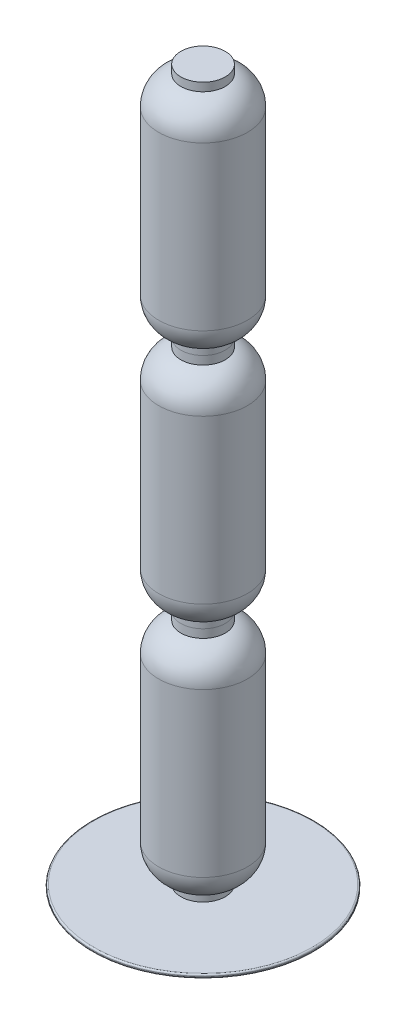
ISO-10303-21;
HEADER;
FILE_DESCRIPTION(('STEP AP214'),'2;1');
FILE_NAME('part.step','',(''),(''),'','','');
FILE_SCHEMA(('AUTOMOTIVE_DESIGN { 1 0 10303 214 1 1 1 1 }'));
ENDSEC;
DATA;
#1=APPLICATION_CONTEXT('core data for automotive mechanical design processes');
#2=APPLICATION_PROTOCOL_DEFINITION('international standard','automotive_design',2000,#1);
#3=PRODUCT_CONTEXT('',#1,'mechanical');
#4=PRODUCT('Part','Part','',(#3));
#5=PRODUCT_RELATED_PRODUCT_CATEGORY('part','',(#4));
#6=PRODUCT_DEFINITION_FORMATION('','',#4);
#7=PRODUCT_DEFINITION_CONTEXT('part definition',#1,'design');
#8=PRODUCT_DEFINITION('design','',#6,#7);
#9=PRODUCT_DEFINITION_SHAPE('','',#8);
#10=(LENGTH_UNIT() NAMED_UNIT(*) SI_UNIT(.MILLI.,.METRE.));
#11=(NAMED_UNIT(*) PLANE_ANGLE_UNIT() SI_UNIT($,.RADIAN.));
#12=(NAMED_UNIT(*) SI_UNIT($,.STERADIAN.) SOLID_ANGLE_UNIT());
#13=UNCERTAINTY_MEASURE_WITH_UNIT(LENGTH_MEASURE(1.E-05),#10,'distance_accuracy_value','');
#14=(GEOMETRIC_REPRESENTATION_CONTEXT(3) GLOBAL_UNCERTAINTY_ASSIGNED_CONTEXT((#13)) GLOBAL_UNIT_ASSIGNED_CONTEXT((#10,
#11,#12)) REPRESENTATION_CONTEXT('',''));
#15=CARTESIAN_POINT('',(0.,0.,0.));
#16=DIRECTION('',(0.,0.,1.));
#17=DIRECTION('',(1.,0.,0.));
#18=AXIS2_PLACEMENT_3D('',#15,#16,#17);
#19=CARTESIAN_POINT('',(0.,-15.,0.));
#20=DIRECTION('',(0.,1.,0.));
#21=DIRECTION('',(0.,0.,1.));
#22=AXIS2_PLACEMENT_3D('',#19,#20,#21);
#23=CYLINDRICAL_SURFACE('',#22,150.);
#24=CARTESIAN_POINT('',(0.,-12.,0.));
#25=DIRECTION('',(0.,-1.,0.));
#26=DIRECTION('',(0.,0.,-1.));
#27=AXIS2_PLACEMENT_3D('',#24,#25,#26);
#28=CIRCLE('',#27,150.);
#29=CARTESIAN_POINT('',(0.,-12.,-150.));
#30=VERTEX_POINT('',#29);
#31=EDGE_CURVE('E50',#30,#30,#28,.T.);
#32=ORIENTED_EDGE('',*,*,#31,.T.);
#33=EDGE_LOOP('',(#32));
#34=FACE_BOUND('',#33,.T.);
#35=CARTESIAN_POINT('',(0.,-13.,0.));
#36=DIRECTION('',(0.,-1.,0.));
#37=DIRECTION('',(0.,0.,-1.));
#38=AXIS2_PLACEMENT_3D('',#35,#36,#37);
#39=CIRCLE('',#38,150.);
#40=CARTESIAN_POINT('',(0.,-13.,-150.));
#41=VERTEX_POINT('',#40);
#42=EDGE_CURVE('E54',#41,#41,#39,.F.);
#43=ORIENTED_EDGE('',*,*,#42,.T.);
#44=EDGE_LOOP('',(#43));
#45=FACE_BOUND('',#44,.T.);
#46=ADVANCED_FACE('F39',(#34,#45),#23,.T.);
#47=CARTESIAN_POINT('',(0.,-15.,0.));
#48=DIRECTION('',(0.,-1.,0.));
#49=DIRECTION('',(0.,0.,-1.));
#50=AXIS2_PLACEMENT_3D('',#47,#48,#49);
#51=PLANE('',#50);
#52=CARTESIAN_POINT('',(0.,-15.,0.));
#53=DIRECTION('',(0.,-1.,0.));
#54=DIRECTION('',(0.,0.,-1.));
#55=AXIS2_PLACEMENT_3D('',#52,#53,#54);
#56=CIRCLE('',#55,148.);
#57=CARTESIAN_POINT('',(0.,-15.,-148.));
#58=VERTEX_POINT('',#57);
#59=EDGE_CURVE('E11',#58,#58,#56,.T.);
#60=ORIENTED_EDGE('',*,*,#59,.T.);
#61=EDGE_LOOP('',(#60));
#62=FACE_BOUND('',#61,.T.);
#63=ADVANCED_FACE('F70',(#62),#51,.T.);
#64=CARTESIAN_POINT('',(0.,-10.,0.));
#65=DIRECTION('',(0.,-1.,0.));
#66=DIRECTION('',(0.,0.,-1.));
#67=AXIS2_PLACEMENT_3D('',#64,#65,#66);
#68=PLANE('',#67);
#69=CARTESIAN_POINT('',(0.,-10.,0.));
#70=DIRECTION('',(0.,-1.,0.));
#71=DIRECTION('',(0.,0.,-1.));
#72=AXIS2_PLACEMENT_3D('',#69,#70,#71);
#73=CIRCLE('',#72,148.);
#74=CARTESIAN_POINT('',(0.,-10.,-148.));
#75=VERTEX_POINT('',#74);
#76=EDGE_CURVE('E46',#75,#75,#73,.F.);
#77=ORIENTED_EDGE('',*,*,#76,.T.);
#78=EDGE_LOOP('',(#77));
#79=FACE_BOUND('',#78,.T.);
#80=ADVANCED_FACE('F67',(#79),#68,.F.);
#81=CARTESIAN_POINT('',(0.,-12.,0.));
#82=DIRECTION('',(0.,-1.,0.));
#83=DIRECTION('',(0.,0.,-1.));
#84=AXIS2_PLACEMENT_3D('',#81,#82,#83);
#85=TOROIDAL_SURFACE('',#84,148.,2.);
#86=ORIENTED_EDGE('',*,*,#76,.F.);
#87=EDGE_LOOP('',(#86));
#88=FACE_BOUND('',#87,.T.);
#89=ORIENTED_EDGE('',*,*,#31,.F.);
#90=EDGE_LOOP('',(#89));
#91=FACE_BOUND('',#90,.T.);
#92=ADVANCED_FACE('F63',(#88,#91),#85,.T.);
#93=CARTESIAN_POINT('',(0.,-13.,0.));
#94=DIRECTION('',(0.,-1.,0.));
#95=DIRECTION('',(0.,0.,-1.));
#96=AXIS2_PLACEMENT_3D('',#93,#94,#95);
#97=TOROIDAL_SURFACE('',#96,148.,2.);
#98=ORIENTED_EDGE('',*,*,#42,.F.);
#99=EDGE_LOOP('',(#98));
#100=FACE_BOUND('',#99,.T.);
#101=ORIENTED_EDGE('',*,*,#59,.F.);
#102=EDGE_LOOP('',(#101));
#103=FACE_BOUND('',#102,.T.);
#104=ADVANCED_FACE('F41',(#100,#103),#97,.T.);
#105=CLOSED_SHELL('',(#46,#63,#80,#92,#104));
#106=MANIFOLD_SOLID_BREP('B2',#105);
#107=CARTESIAN_POINT('',(0.,630.,0.));
#108=DIRECTION('',(0.,1.,0.));
#109=DIRECTION('',(0.,0.,-1.));
#110=AXIS2_PLACEMENT_3D('',#107,#108,#109);
#111=CYLINDRICAL_SURFACE('',#110,30.);
#112=CARTESIAN_POINT('',(0.,630.,0.));
#113=DIRECTION('',(0.,1.,0.));
#114=DIRECTION('',(0.,0.,1.));
#115=AXIS2_PLACEMENT_3D('',#112,#113,#114);
#116=CIRCLE('',#115,30.);
#117=CARTESIAN_POINT('',(0.,630.,30.));
#118=VERTEX_POINT('',#117);
#119=EDGE_CURVE('E123',#118,#118,#116,.T.);
#120=ORIENTED_EDGE('',*,*,#119,.T.);
#121=EDGE_LOOP('',(#120));
#122=FACE_BOUND('',#121,.T.);
#123=CARTESIAN_POINT('',(0.,641.270166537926,0.));
#124=DIRECTION('',(0.,-1.,0.));
#125=DIRECTION('',(0.,0.,-1.));
#126=AXIS2_PLACEMENT_3D('',#123,#124,#125);
#127=CIRCLE('',#126,30.);
#128=CARTESIAN_POINT('',(0.,641.270166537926,-30.));
#129=VERTEX_POINT('',#128);
#130=EDGE_CURVE('E127',#129,#129,#127,.F.);
#131=ORIENTED_EDGE('',*,*,#130,.F.);
#132=EDGE_LOOP('',(#131));
#133=FACE_BOUND('',#132,.T.);
#134=ADVANCED_FACE('F117',(#122,#133),#111,.T.);
#135=CARTESIAN_POINT('',(0.,630.,0.));
#136=DIRECTION('',(0.,-1.,0.));
#137=DIRECTION('',(0.,0.,1.));
#138=AXIS2_PLACEMENT_3D('',#135,#136,#137);
#139=PLANE('',#138);
#140=ORIENTED_EDGE('',*,*,#119,.F.);
#141=EDGE_LOOP('',(#140));
#142=FACE_BOUND('',#141,.T.);
#143=ADVANCED_FACE('F138',(#142),#139,.T.);
#144=CARTESIAN_POINT('',(0.,680.,0.));
#145=DIRECTION('',(0.,1.,0.));
#146=DIRECTION('',(0.,0.,-1.));
#147=AXIS2_PLACEMENT_3D('',#144,#145,#146);
#148=DEGENERATE_TOROIDAL_SURFACE('',#147,20.,40.,.T.);
#149=ORIENTED_EDGE('',*,*,#130,.T.);
#150=EDGE_LOOP('',(#149));
#151=FACE_BOUND('',#150,.T.);
#152=CARTESIAN_POINT('',(0.,640.,0.));
#153=DIRECTION('',(0.,-1.,0.));
#154=DIRECTION('',(0.,0.,-1.));
#155=AXIS2_PLACEMENT_3D('',#152,#153,#154);
#156=CIRCLE('',#155,20.);
#157=CARTESIAN_POINT('',(0.,640.,-20.));
#158=VERTEX_POINT('',#157);
#159=EDGE_CURVE('E38',#158,#158,#156,.F.);
#160=ORIENTED_EDGE('',*,*,#159,.F.);
#161=EDGE_LOOP('',(#160));
#162=FACE_BOUND('',#161,.T.);
#163=ADVANCED_FACE('F134',(#151,#162),#148,.F.);
#164=CARTESIAN_POINT('',(0.,640.,0.));
#165=DIRECTION('',(0.,-1.,0.));
#166=DIRECTION('',(0.,0.,1.));
#167=AXIS2_PLACEMENT_3D('',#164,#165,#166);
#168=PLANE('',#167);
#169=ORIENTED_EDGE('',*,*,#159,.T.);
#170=EDGE_LOOP('',(#169));
#171=FACE_BOUND('',#170,.T.);
#172=ADVANCED_FACE('F147',(#171),#168,.F.);
#173=CLOSED_SHELL('',(#134,#143,#163,#172));
#174=MANIFOLD_SOLID_BREP('B6',#173);
#175=CARTESIAN_POINT('',(0.,310.,0.));
#176=DIRECTION('',(0.,1.,0.));
#177=DIRECTION('',(0.,0.,-1.));
#178=AXIS2_PLACEMENT_3D('',#175,#176,#177);
#179=CYLINDRICAL_SURFACE('',#178,30.);
#180=CARTESIAN_POINT('',(0.,310.,0.));
#181=DIRECTION('',(0.,1.,0.));
#182=DIRECTION('',(0.,0.,1.));
#183=AXIS2_PLACEMENT_3D('',#180,#181,#182);
#184=CIRCLE('',#183,30.);
#185=CARTESIAN_POINT('',(0.,310.,30.));
#186=VERTEX_POINT('',#185);
#187=EDGE_CURVE('E186',#186,#186,#184,.T.);
#188=ORIENTED_EDGE('',*,*,#187,.T.);
#189=EDGE_LOOP('',(#188));
#190=FACE_BOUND('',#189,.T.);
#191=CARTESIAN_POINT('',(0.,321.270166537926,0.));
#192=DIRECTION('',(0.,-1.,0.));
#193=DIRECTION('',(0.,0.,-1.));
#194=AXIS2_PLACEMENT_3D('',#191,#192,#193);
#195=CIRCLE('',#194,30.);
#196=CARTESIAN_POINT('',(0.,321.270166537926,-30.));
#197=VERTEX_POINT('',#196);
#198=EDGE_CURVE('E190',#197,#197,#195,.F.);
#199=ORIENTED_EDGE('',*,*,#198,.F.);
#200=EDGE_LOOP('',(#199));
#201=FACE_BOUND('',#200,.T.);
#202=ADVANCED_FACE('F180',(#190,#201),#179,.T.);
#203=CARTESIAN_POINT('',(0.,310.,0.));
#204=DIRECTION('',(0.,-1.,0.));
#205=DIRECTION('',(0.,0.,1.));
#206=AXIS2_PLACEMENT_3D('',#203,#204,#205);
#207=PLANE('',#206);
#208=ORIENTED_EDGE('',*,*,#187,.F.);
#209=EDGE_LOOP('',(#208));
#210=FACE_BOUND('',#209,.T.);
#211=ADVANCED_FACE('F201',(#210),#207,.T.);
#212=CARTESIAN_POINT('',(0.,360.,0.));
#213=DIRECTION('',(0.,1.,0.));
#214=DIRECTION('',(0.,0.,-1.));
#215=AXIS2_PLACEMENT_3D('',#212,#213,#214);
#216=DEGENERATE_TOROIDAL_SURFACE('',#215,20.,40.,.T.);
#217=ORIENTED_EDGE('',*,*,#198,.T.);
#218=EDGE_LOOP('',(#217));
#219=FACE_BOUND('',#218,.T.);
#220=CARTESIAN_POINT('',(0.,320.,0.));
#221=DIRECTION('',(0.,-1.,0.));
#222=DIRECTION('',(0.,0.,-1.));
#223=AXIS2_PLACEMENT_3D('',#220,#221,#222);
#224=CIRCLE('',#223,20.);
#225=CARTESIAN_POINT('',(0.,320.,-20.));
#226=VERTEX_POINT('',#225);
#227=EDGE_CURVE('E116',#226,#226,#224,.F.);
#228=ORIENTED_EDGE('',*,*,#227,.F.);
#229=EDGE_LOOP('',(#228));
#230=FACE_BOUND('',#229,.T.);
#231=ADVANCED_FACE('F197',(#219,#230),#216,.F.);
#232=CARTESIAN_POINT('',(0.,320.,0.));
#233=DIRECTION('',(0.,-1.,0.));
#234=DIRECTION('',(0.,0.,1.));
#235=AXIS2_PLACEMENT_3D('',#232,#233,#234);
#236=PLANE('',#235);
#237=ORIENTED_EDGE('',*,*,#227,.T.);
#238=EDGE_LOOP('',(#237));
#239=FACE_BOUND('',#238,.T.);
#240=ADVANCED_FACE('F210',(#239),#236,.F.);
#241=CLOSED_SHELL('',(#202,#211,#231,#240));
#242=MANIFOLD_SOLID_BREP('B33',#241);
#243=CARTESIAN_POINT('',(-20.,940.,0.));
#244=DIRECTION('',(0.,-1.,0.));
#245=DIRECTION('',(0.,0.,-1.));
#246=AXIS2_PLACEMENT_3D('',#243,#244,#245);
#247=PLANE('',#246);
#248=CARTESIAN_POINT('',(0.,940.,0.));
#249=DIRECTION('',(0.,-1.,0.));
#250=DIRECTION('',(0.,0.,-1.));
#251=AXIS2_PLACEMENT_3D('',#248,#249,#250);
#252=CIRCLE('',#251,20.);
#253=CARTESIAN_POINT('',(0.,940.,-20.));
#254=VERTEX_POINT('',#253);
#255=EDGE_CURVE('E179',#254,#254,#252,.T.);
#256=ORIENTED_EDGE('',*,*,#255,.F.);
#257=EDGE_LOOP('',(#256));
#258=FACE_BOUND('',#257,.T.);
#259=ADVANCED_FACE('F243',(#258),#247,.F.);
#260=CARTESIAN_POINT('',(0.,900.,0.));
#261=DIRECTION('',(0.,-1.,0.));
#262=DIRECTION('',(0.,0.,-1.));
#263=AXIS2_PLACEMENT_3D('',#260,#261,#262);
#264=DEGENERATE_TOROIDAL_SURFACE('',#263,20.,40.,.T.);
#265=CARTESIAN_POINT('',(0.,900.,0.));
#266=DIRECTION('',(0.,-1.,0.));
#267=DIRECTION('',(0.,0.,-1.));
#268=AXIS2_PLACEMENT_3D('',#265,#266,#267);
#269=CIRCLE('',#268,60.);
#270=CARTESIAN_POINT('',(0.,900.,-60.));
#271=VERTEX_POINT('',#270);
#272=EDGE_CURVE('E249',#271,#271,#269,.T.);
#273=ORIENTED_EDGE('',*,*,#272,.F.);
#274=EDGE_LOOP('',(#273));
#275=FACE_BOUND('',#274,.T.);
#276=ORIENTED_EDGE('',*,*,#255,.T.);
#277=EDGE_LOOP('',(#276));
#278=FACE_BOUND('',#277,.T.);
#279=ADVANCED_FACE('F286',(#275,#278),#264,.T.);
#280=CARTESIAN_POINT('',(0.,640.,0.));
#281=DIRECTION('',(0.,-1.,0.));
#282=DIRECTION('',(0.,0.,-1.));
#283=AXIS2_PLACEMENT_3D('',#280,#281,#282);
#284=CYLINDRICAL_SURFACE('',#283,60.);
#285=CARTESIAN_POINT('',(0.,680.,0.));
#286=DIRECTION('',(0.,-1.,0.));
#287=DIRECTION('',(0.,0.,-1.));
#288=AXIS2_PLACEMENT_3D('',#285,#286,#287);
#289=CIRCLE('',#288,60.);
#290=CARTESIAN_POINT('',(0.,680.,-60.));
#291=VERTEX_POINT('',#290);
#292=EDGE_CURVE('E253',#291,#291,#289,.T.);
#293=ORIENTED_EDGE('',*,*,#292,.F.);
#294=EDGE_LOOP('',(#293));
#295=FACE_BOUND('',#294,.T.);
#296=ORIENTED_EDGE('',*,*,#272,.T.);
#297=EDGE_LOOP('',(#296));
#298=FACE_BOUND('',#297,.T.);
#299=ADVANCED_FACE('F281',(#295,#298),#284,.T.);
#300=CARTESIAN_POINT('',(0.,680.,0.));
#301=DIRECTION('',(0.,-1.,0.));
#302=DIRECTION('',(0.,0.,-1.));
#303=AXIS2_PLACEMENT_3D('',#300,#301,#302);
#304=DEGENERATE_TOROIDAL_SURFACE('',#303,20.,40.,.T.);
#305=CARTESIAN_POINT('',(0.,640.,0.));
#306=DIRECTION('',(0.,-1.,0.));
#307=DIRECTION('',(0.,0.,-1.));
#308=AXIS2_PLACEMENT_3D('',#305,#306,#307);
#309=CIRCLE('',#308,20.);
#310=CARTESIAN_POINT('',(0.,640.,-20.));
#311=VERTEX_POINT('',#310);
#312=EDGE_CURVE('E267',#311,#311,#309,.T.);
#313=ORIENTED_EDGE('',*,*,#312,.F.);
#314=EDGE_LOOP('',(#313));
#315=FACE_BOUND('',#314,.T.);
#316=ORIENTED_EDGE('',*,*,#292,.T.);
#317=EDGE_LOOP('',(#316));
#318=FACE_BOUND('',#317,.T.);
#319=ADVANCED_FACE('F278',(#315,#318),#304,.T.);
#320=CARTESIAN_POINT('',(0.,640.,0.));
#321=DIRECTION('',(0.,1.,0.));
#322=DIRECTION('',(0.,0.,1.));
#323=AXIS2_PLACEMENT_3D('',#320,#321,#322);
#324=CYLINDRICAL_SURFACE('',#323,20.);
#325=ORIENTED_EDGE('',*,*,#312,.T.);
#326=EDGE_LOOP('',(#325));
#327=FACE_BOUND('',#326,.T.);
#328=CARTESIAN_POINT('',(0.,648.,0.));
#329=DIRECTION('',(0.,1.,0.));
#330=DIRECTION('',(0.,0.,1.));
#331=AXIS2_PLACEMENT_3D('',#328,#329,#330);
#332=CIRCLE('',#331,20.);
#333=CARTESIAN_POINT('',(0.,648.,20.));
#334=VERTEX_POINT('',#333);
#335=EDGE_CURVE('E257',#334,#334,#332,.F.);
#336=ORIENTED_EDGE('',*,*,#335,.F.);
#337=EDGE_LOOP('',(#336));
#338=FACE_BOUND('',#337,.T.);
#339=ADVANCED_FACE('F275',(#327,#338),#324,.F.);
#340=CARTESIAN_POINT('',(-20.,932.,0.));
#341=DIRECTION('',(0.,-1.,0.));
#342=DIRECTION('',(0.,0.,-1.));
#343=AXIS2_PLACEMENT_3D('',#340,#341,#342);
#344=PLANE('',#343);
#345=CARTESIAN_POINT('',(0.,932.,0.));
#346=DIRECTION('',(0.,-1.,0.));
#347=DIRECTION('',(0.,0.,-1.));
#348=AXIS2_PLACEMENT_3D('',#345,#346,#347);
#349=CIRCLE('',#348,20.);
#350=CARTESIAN_POINT('',(0.,932.,-20.));
#351=VERTEX_POINT('',#350);
#352=EDGE_CURVE('E262',#351,#351,#349,.T.);
#353=ORIENTED_EDGE('',*,*,#352,.T.);
#354=EDGE_LOOP('',(#353));
#355=FACE_BOUND('',#354,.T.);
#356=ADVANCED_FACE('F319',(#355),#344,.T.);
#357=CARTESIAN_POINT('',(0.,900.,0.));
#358=DIRECTION('',(0.,-1.,0.));
#359=DIRECTION('',(0.,0.,-1.));
#360=AXIS2_PLACEMENT_3D('',#357,#358,#359);
#361=DEGENERATE_TOROIDAL_SURFACE('',#360,20.,32.,.T.);
#362=CARTESIAN_POINT('',(0.,900.,0.));
#363=DIRECTION('',(0.,-1.,0.));
#364=DIRECTION('',(0.,0.,-1.));
#365=AXIS2_PLACEMENT_3D('',#362,#363,#364);
#366=CIRCLE('',#365,52.);
#367=CARTESIAN_POINT('',(0.,900.,-52.));
#368=VERTEX_POINT('',#367);
#369=EDGE_CURVE('E266',#368,#368,#366,.T.);
#370=ORIENTED_EDGE('',*,*,#369,.T.);
#371=EDGE_LOOP('',(#370));
#372=FACE_BOUND('',#371,.T.);
#373=ORIENTED_EDGE('',*,*,#352,.F.);
#374=EDGE_LOOP('',(#373));
#375=FACE_BOUND('',#374,.T.);
#376=ADVANCED_FACE('F328',(#372,#375),#361,.F.);
#377=CARTESIAN_POINT('',(0.,640.,0.));
#378=DIRECTION('',(0.,-1.,0.));
#379=DIRECTION('',(0.,0.,-1.));
#380=AXIS2_PLACEMENT_3D('',#377,#378,#379);
#381=CYLINDRICAL_SURFACE('',#380,52.);
#382=CARTESIAN_POINT('',(0.,680.,0.));
#383=DIRECTION('',(0.,-1.,0.));
#384=DIRECTION('',(0.,0.,-1.));
#385=AXIS2_PLACEMENT_3D('',#382,#383,#384);
#386=CIRCLE('',#385,52.);
#387=CARTESIAN_POINT('',(0.,680.,-52.));
#388=VERTEX_POINT('',#387);
#389=EDGE_CURVE('E263',#388,#388,#386,.T.);
#390=ORIENTED_EDGE('',*,*,#389,.T.);
#391=EDGE_LOOP('',(#390));
#392=FACE_BOUND('',#391,.T.);
#393=ORIENTED_EDGE('',*,*,#369,.F.);
#394=EDGE_LOOP('',(#393));
#395=FACE_BOUND('',#394,.T.);
#396=ADVANCED_FACE('F338',(#392,#395),#381,.F.);
#397=CARTESIAN_POINT('',(0.,680.,0.));
#398=DIRECTION('',(0.,-1.,0.));
#399=DIRECTION('',(0.,0.,-1.));
#400=AXIS2_PLACEMENT_3D('',#397,#398,#399);
#401=DEGENERATE_TOROIDAL_SURFACE('',#400,20.,32.,.T.);
#402=ORIENTED_EDGE('',*,*,#335,.T.);
#403=EDGE_LOOP('',(#402));
#404=FACE_BOUND('',#403,.T.);
#405=ORIENTED_EDGE('',*,*,#389,.F.);
#406=EDGE_LOOP('',(#405));
#407=FACE_BOUND('',#406,.T.);
#408=ADVANCED_FACE('F348',(#404,#407),#401,.F.);
#409=CLOSED_SHELL('',(#259,#279,#299,#319,#339,#356,#376,#396,#408));
#410=MANIFOLD_SOLID_BREP('B111',#409);
#411=CARTESIAN_POINT('',(-20.,620.,0.));
#412=DIRECTION('',(0.,-1.,0.));
#413=DIRECTION('',(0.,0.,-1.));
#414=AXIS2_PLACEMENT_3D('',#411,#412,#413);
#415=PLANE('',#414);
#416=CARTESIAN_POINT('',(0.,620.,0.));
#417=DIRECTION('',(0.,-1.,0.));
#418=DIRECTION('',(0.,0.,-1.));
#419=AXIS2_PLACEMENT_3D('',#416,#417,#418);
#420=CIRCLE('',#419,20.);
#421=CARTESIAN_POINT('',(0.,620.,-20.));
#422=VERTEX_POINT('',#421);
#423=EDGE_CURVE('E242',#422,#422,#420,.T.);
#424=ORIENTED_EDGE('',*,*,#423,.F.);
#425=EDGE_LOOP('',(#424));
#426=FACE_BOUND('',#425,.T.);
#427=ADVANCED_FACE('F381',(#426),#415,.F.);
#428=CARTESIAN_POINT('',(0.,580.,0.));
#429=DIRECTION('',(0.,-1.,0.));
#430=DIRECTION('',(0.,0.,-1.));
#431=AXIS2_PLACEMENT_3D('',#428,#429,#430);
#432=DEGENERATE_TOROIDAL_SURFACE('',#431,20.,40.,.T.);
#433=CARTESIAN_POINT('',(0.,580.,0.));
#434=DIRECTION('',(0.,-1.,0.));
#435=DIRECTION('',(0.,0.,-1.));
#436=AXIS2_PLACEMENT_3D('',#433,#434,#435);
#437=CIRCLE('',#436,60.);
#438=CARTESIAN_POINT('',(0.,580.,-60.));
#439=VERTEX_POINT('',#438);
#440=EDGE_CURVE('E387',#439,#439,#437,.T.);
#441=ORIENTED_EDGE('',*,*,#440,.F.);
#442=EDGE_LOOP('',(#441));
#443=FACE_BOUND('',#442,.T.);
#444=ORIENTED_EDGE('',*,*,#423,.T.);
#445=EDGE_LOOP('',(#444));
#446=FACE_BOUND('',#445,.T.);
#447=ADVANCED_FACE('F424',(#443,#446),#432,.T.);
#448=CARTESIAN_POINT('',(0.,320.,0.));
#449=DIRECTION('',(0.,-1.,0.));
#450=DIRECTION('',(0.,0.,-1.));
#451=AXIS2_PLACEMENT_3D('',#448,#449,#450);
#452=CYLINDRICAL_SURFACE('',#451,60.);
#453=CARTESIAN_POINT('',(0.,360.,0.));
#454=DIRECTION('',(0.,-1.,0.));
#455=DIRECTION('',(0.,0.,-1.));
#456=AXIS2_PLACEMENT_3D('',#453,#454,#455);
#457=CIRCLE('',#456,60.);
#458=CARTESIAN_POINT('',(0.,360.,-60.));
#459=VERTEX_POINT('',#458);
#460=EDGE_CURVE('E391',#459,#459,#457,.T.);
#461=ORIENTED_EDGE('',*,*,#460,.F.);
#462=EDGE_LOOP('',(#461));
#463=FACE_BOUND('',#462,.T.);
#464=ORIENTED_EDGE('',*,*,#440,.T.);
#465=EDGE_LOOP('',(#464));
#466=FACE_BOUND('',#465,.T.);
#467=ADVANCED_FACE('F419',(#463,#466),#452,.T.);
#468=CARTESIAN_POINT('',(0.,360.,0.));
#469=DIRECTION('',(0.,-1.,0.));
#470=DIRECTION('',(0.,0.,-1.));
#471=AXIS2_PLACEMENT_3D('',#468,#469,#470);
#472=DEGENERATE_TOROIDAL_SURFACE('',#471,20.,40.,.T.);
#473=CARTESIAN_POINT('',(0.,320.,0.));
#474=DIRECTION('',(0.,-1.,0.));
#475=DIRECTION('',(0.,0.,-1.));
#476=AXIS2_PLACEMENT_3D('',#473,#474,#475);
#477=CIRCLE('',#476,20.);
#478=CARTESIAN_POINT('',(0.,320.,-20.));
#479=VERTEX_POINT('',#478);
#480=EDGE_CURVE('E405',#479,#479,#477,.T.);
#481=ORIENTED_EDGE('',*,*,#480,.F.);
#482=EDGE_LOOP('',(#481));
#483=FACE_BOUND('',#482,.T.);
#484=ORIENTED_EDGE('',*,*,#460,.T.);
#485=EDGE_LOOP('',(#484));
#486=FACE_BOUND('',#485,.T.);
#487=ADVANCED_FACE('F416',(#483,#486),#472,.T.);
#488=CARTESIAN_POINT('',(0.,320.,0.));
#489=DIRECTION('',(0.,1.,0.));
#490=DIRECTION('',(0.,0.,1.));
#491=AXIS2_PLACEMENT_3D('',#488,#489,#490);
#492=CYLINDRICAL_SURFACE('',#491,20.);
#493=ORIENTED_EDGE('',*,*,#480,.T.);
#494=EDGE_LOOP('',(#493));
#495=FACE_BOUND('',#494,.T.);
#496=CARTESIAN_POINT('',(0.,328.,0.));
#497=DIRECTION('',(0.,1.,0.));
#498=DIRECTION('',(0.,0.,1.));
#499=AXIS2_PLACEMENT_3D('',#496,#497,#498);
#500=CIRCLE('',#499,20.);
#501=CARTESIAN_POINT('',(0.,328.,20.));
#502=VERTEX_POINT('',#501);
#503=EDGE_CURVE('E395',#502,#502,#500,.F.);
#504=ORIENTED_EDGE('',*,*,#503,.F.);
#505=EDGE_LOOP('',(#504));
#506=FACE_BOUND('',#505,.T.);
#507=ADVANCED_FACE('F413',(#495,#506),#492,.F.);
#508=CARTESIAN_POINT('',(-20.,612.,0.));
#509=DIRECTION('',(0.,-1.,0.));
#510=DIRECTION('',(0.,0.,-1.));
#511=AXIS2_PLACEMENT_3D('',#508,#509,#510);
#512=PLANE('',#511);
#513=CARTESIAN_POINT('',(0.,612.,0.));
#514=DIRECTION('',(0.,-1.,0.));
#515=DIRECTION('',(0.,0.,-1.));
#516=AXIS2_PLACEMENT_3D('',#513,#514,#515);
#517=CIRCLE('',#516,20.);
#518=CARTESIAN_POINT('',(0.,612.,-20.));
#519=VERTEX_POINT('',#518);
#520=EDGE_CURVE('E400',#519,#519,#517,.T.);
#521=ORIENTED_EDGE('',*,*,#520,.T.);
#522=EDGE_LOOP('',(#521));
#523=FACE_BOUND('',#522,.T.);
#524=ADVANCED_FACE('F457',(#523),#512,.T.);
#525=CARTESIAN_POINT('',(0.,580.,0.));
#526=DIRECTION('',(0.,-1.,0.));
#527=DIRECTION('',(0.,0.,-1.));
#528=AXIS2_PLACEMENT_3D('',#525,#526,#527);
#529=DEGENERATE_TOROIDAL_SURFACE('',#528,20.,32.,.T.);
#530=CARTESIAN_POINT('',(0.,580.,0.));
#531=DIRECTION('',(0.,-1.,0.));
#532=DIRECTION('',(0.,0.,-1.));
#533=AXIS2_PLACEMENT_3D('',#530,#531,#532);
#534=CIRCLE('',#533,52.);
#535=CARTESIAN_POINT('',(0.,580.,-52.));
#536=VERTEX_POINT('',#535);
#537=EDGE_CURVE('E404',#536,#536,#534,.T.);
#538=ORIENTED_EDGE('',*,*,#537,.T.);
#539=EDGE_LOOP('',(#538));
#540=FACE_BOUND('',#539,.T.);
#541=ORIENTED_EDGE('',*,*,#520,.F.);
#542=EDGE_LOOP('',(#541));
#543=FACE_BOUND('',#542,.T.);
#544=ADVANCED_FACE('F466',(#540,#543),#529,.F.);
#545=CARTESIAN_POINT('',(0.,320.,0.));
#546=DIRECTION('',(0.,-1.,0.));
#547=DIRECTION('',(0.,0.,-1.));
#548=AXIS2_PLACEMENT_3D('',#545,#546,#547);
#549=CYLINDRICAL_SURFACE('',#548,52.);
#550=CARTESIAN_POINT('',(0.,360.,0.));
#551=DIRECTION('',(0.,-1.,0.));
#552=DIRECTION('',(0.,0.,-1.));
#553=AXIS2_PLACEMENT_3D('',#550,#551,#552);
#554=CIRCLE('',#553,52.);
#555=CARTESIAN_POINT('',(0.,360.,-52.));
#556=VERTEX_POINT('',#555);
#557=EDGE_CURVE('E401',#556,#556,#554,.T.);
#558=ORIENTED_EDGE('',*,*,#557,.T.);
#559=EDGE_LOOP('',(#558));
#560=FACE_BOUND('',#559,.T.);
#561=ORIENTED_EDGE('',*,*,#537,.F.);
#562=EDGE_LOOP('',(#561));
#563=FACE_BOUND('',#562,.T.);
#564=ADVANCED_FACE('F476',(#560,#563),#549,.F.);
#565=CARTESIAN_POINT('',(0.,360.,0.));
#566=DIRECTION('',(0.,-1.,0.));
#567=DIRECTION('',(0.,0.,-1.));
#568=AXIS2_PLACEMENT_3D('',#565,#566,#567);
#569=DEGENERATE_TOROIDAL_SURFACE('',#568,20.,32.,.T.);
#570=ORIENTED_EDGE('',*,*,#503,.T.);
#571=EDGE_LOOP('',(#570));
#572=FACE_BOUND('',#571,.T.);
#573=ORIENTED_EDGE('',*,*,#557,.F.);
#574=EDGE_LOOP('',(#573));
#575=FACE_BOUND('',#574,.T.);
#576=ADVANCED_FACE('F486',(#572,#575),#569,.F.);
#577=CLOSED_SHELL('',(#427,#447,#467,#487,#507,#524,#544,#564,#576));
#578=MANIFOLD_SOLID_BREP('B174',#577);
#579=CARTESIAN_POINT('',(0.,950.,0.));
#580=DIRECTION('',(0.,-1.,0.));
#581=DIRECTION('',(0.,0.,-1.));
#582=AXIS2_PLACEMENT_3D('',#579,#580,#581);
#583=CYLINDRICAL_SURFACE('',#582,30.);
#584=CARTESIAN_POINT('',(0.,950.,0.));
#585=DIRECTION('',(0.,1.,0.));
#586=DIRECTION('',(0.,0.,1.));
#587=AXIS2_PLACEMENT_3D('',#584,#585,#586);
#588=CIRCLE('',#587,30.);
#589=CARTESIAN_POINT('',(0.,950.,30.));
#590=VERTEX_POINT('',#589);
#591=EDGE_CURVE('E525',#590,#590,#588,.T.);
#592=ORIENTED_EDGE('',*,*,#591,.F.);
#593=EDGE_LOOP('',(#592));
#594=FACE_BOUND('',#593,.T.);
#595=CARTESIAN_POINT('',(0.,938.729833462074,0.));
#596=DIRECTION('',(0.,-1.,0.));
#597=DIRECTION('',(0.,0.,-1.));
#598=AXIS2_PLACEMENT_3D('',#595,#596,#597);
#599=CIRCLE('',#598,30.);
#600=CARTESIAN_POINT('',(0.,938.729833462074,-30.));
#601=VERTEX_POINT('',#600);
#602=EDGE_CURVE('E529',#601,#601,#599,.F.);
#603=ORIENTED_EDGE('',*,*,#602,.T.);
#604=EDGE_LOOP('',(#603));
#605=FACE_BOUND('',#604,.T.);
#606=ADVANCED_FACE('F519',(#594,#605),#583,.T.);
#607=CARTESIAN_POINT('',(0.,950.,0.));
#608=DIRECTION('',(0.,1.,0.));
#609=DIRECTION('',(0.,0.,1.));
#610=AXIS2_PLACEMENT_3D('',#607,#608,#609);
#611=PLANE('',#610);
#612=ORIENTED_EDGE('',*,*,#591,.T.);
#613=EDGE_LOOP('',(#612));
#614=FACE_BOUND('',#613,.T.);
#615=ADVANCED_FACE('F540',(#614),#611,.T.);
#616=CARTESIAN_POINT('',(0.,900.,0.));
#617=DIRECTION('',(0.,-1.,0.));
#618=DIRECTION('',(0.,0.,-1.));
#619=AXIS2_PLACEMENT_3D('',#616,#617,#618);
#620=DEGENERATE_TOROIDAL_SURFACE('',#619,20.,40.,.T.);
#621=ORIENTED_EDGE('',*,*,#602,.F.);
#622=EDGE_LOOP('',(#621));
#623=FACE_BOUND('',#622,.T.);
#624=CARTESIAN_POINT('',(0.,940.,0.));
#625=DIRECTION('',(0.,-1.,0.));
#626=DIRECTION('',(0.,0.,-1.));
#627=AXIS2_PLACEMENT_3D('',#624,#625,#626);
#628=CIRCLE('',#627,20.);
#629=CARTESIAN_POINT('',(0.,940.,-20.));
#630=VERTEX_POINT('',#629);
#631=EDGE_CURVE('E380',#630,#630,#628,.F.);
#632=ORIENTED_EDGE('',*,*,#631,.T.);
#633=EDGE_LOOP('',(#632));
#634=FACE_BOUND('',#633,.T.);
#635=ADVANCED_FACE('F537',(#623,#634),#620,.F.);
#636=CARTESIAN_POINT('',(0.,940.,0.));
#637=DIRECTION('',(0.,1.,0.));
#638=DIRECTION('',(0.,0.,1.));
#639=AXIS2_PLACEMENT_3D('',#636,#637,#638);
#640=PLANE('',#639);
#641=ORIENTED_EDGE('',*,*,#631,.F.);
#642=EDGE_LOOP('',(#641));
#643=FACE_BOUND('',#642,.T.);
#644=ADVANCED_FACE('F539',(#643),#640,.F.);
#645=CLOSED_SHELL('',(#606,#615,#635,#644));
#646=MANIFOLD_SOLID_BREP('B237',#645);
#647=CARTESIAN_POINT('',(0.,630.,0.));
#648=DIRECTION('',(0.,-1.,0.));
#649=DIRECTION('',(0.,0.,-1.));
#650=AXIS2_PLACEMENT_3D('',#647,#648,#649);
#651=CYLINDRICAL_SURFACE('',#650,30.);
#652=CARTESIAN_POINT('',(0.,630.,0.));
#653=DIRECTION('',(0.,1.,0.));
#654=DIRECTION('',(0.,0.,1.));
#655=AXIS2_PLACEMENT_3D('',#652,#653,#654);
#656=CIRCLE('',#655,30.);
#657=CARTESIAN_POINT('',(0.,630.,30.));
#658=VERTEX_POINT('',#657);
#659=EDGE_CURVE('E588',#658,#658,#656,.T.);
#660=ORIENTED_EDGE('',*,*,#659,.F.);
#661=EDGE_LOOP('',(#660));
#662=FACE_BOUND('',#661,.T.);
#663=CARTESIAN_POINT('',(0.,618.729833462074,0.));
#664=DIRECTION('',(0.,-1.,0.));
#665=DIRECTION('',(0.,0.,-1.));
#666=AXIS2_PLACEMENT_3D('',#663,#664,#665);
#667=CIRCLE('',#666,30.);
#668=CARTESIAN_POINT('',(0.,618.729833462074,-30.));
#669=VERTEX_POINT('',#668);
#670=EDGE_CURVE('E592',#669,#669,#667,.F.);
#671=ORIENTED_EDGE('',*,*,#670,.T.);
#672=EDGE_LOOP('',(#671));
#673=FACE_BOUND('',#672,.T.);
#674=ADVANCED_FACE('F582',(#662,#673),#651,.T.);
#675=CARTESIAN_POINT('',(0.,630.,0.));
#676=DIRECTION('',(0.,1.,0.));
#677=DIRECTION('',(0.,0.,1.));
#678=AXIS2_PLACEMENT_3D('',#675,#676,#677);
#679=PLANE('',#678);
#680=ORIENTED_EDGE('',*,*,#659,.T.);
#681=EDGE_LOOP('',(#680));
#682=FACE_BOUND('',#681,.T.);
#683=ADVANCED_FACE('F603',(#682),#679,.T.);
#684=CARTESIAN_POINT('',(0.,580.,0.));
#685=DIRECTION('',(0.,-1.,0.));
#686=DIRECTION('',(0.,0.,-1.));
#687=AXIS2_PLACEMENT_3D('',#684,#685,#686);
#688=DEGENERATE_TOROIDAL_SURFACE('',#687,20.,40.,.T.);
#689=ORIENTED_EDGE('',*,*,#670,.F.);
#690=EDGE_LOOP('',(#689));
#691=FACE_BOUND('',#690,.T.);
#692=CARTESIAN_POINT('',(0.,620.,0.));
#693=DIRECTION('',(0.,-1.,0.));
#694=DIRECTION('',(0.,0.,-1.));
#695=AXIS2_PLACEMENT_3D('',#692,#693,#694);
#696=CIRCLE('',#695,20.);
#697=CARTESIAN_POINT('',(0.,620.,-20.));
#698=VERTEX_POINT('',#697);
#699=EDGE_CURVE('E518',#698,#698,#696,.F.);
#700=ORIENTED_EDGE('',*,*,#699,.T.);
#701=EDGE_LOOP('',(#700));
#702=FACE_BOUND('',#701,.T.);
#703=ADVANCED_FACE('F600',(#691,#702),#688,.F.);
#704=CARTESIAN_POINT('',(0.,620.,0.));
#705=DIRECTION('',(0.,1.,0.));
#706=DIRECTION('',(0.,0.,1.));
#707=AXIS2_PLACEMENT_3D('',#704,#705,#706);
#708=PLANE('',#707);
#709=ORIENTED_EDGE('',*,*,#699,.F.);
#710=EDGE_LOOP('',(#709));
#711=FACE_BOUND('',#710,.T.);
#712=ADVANCED_FACE('F602',(#711),#708,.F.);
#713=CLOSED_SHELL('',(#674,#683,#703,#712));
#714=MANIFOLD_SOLID_BREP('B375',#713);
#715=CARTESIAN_POINT('',(0.,5.,0.));
#716=DIRECTION('',(0.,1.,0.));
#717=DIRECTION('',(0.,0.,1.));
#718=AXIS2_PLACEMENT_3D('',#715,#716,#717);
#719=CYLINDRICAL_SURFACE('',#718,30.);
#720=CARTESIAN_POINT('',(0.,5.,0.));
#721=DIRECTION('',(0.,1.,0.));
#722=DIRECTION('',(0.,0.,1.));
#723=AXIS2_PLACEMENT_3D('',#720,#721,#722);
#724=CIRCLE('',#723,30.);
#725=CARTESIAN_POINT('',(0.,5.,30.));
#726=VERTEX_POINT('',#725);
#727=EDGE_CURVE('E581',#726,#726,#724,.T.);
#728=ORIENTED_EDGE('',*,*,#727,.T.);
#729=EDGE_LOOP('',(#728));
#730=FACE_BOUND('',#729,.T.);
#731=CARTESIAN_POINT('',(0.,295.,0.));
#732=DIRECTION('',(0.,1.,0.));
#733=DIRECTION('',(0.,0.,1.));
#734=AXIS2_PLACEMENT_3D('',#731,#732,#733);
#735=CIRCLE('',#734,30.);
#736=CARTESIAN_POINT('',(0.,295.,30.));
#737=VERTEX_POINT('',#736);
#738=EDGE_CURVE('E651',#737,#737,#735,.T.);
#739=ORIENTED_EDGE('',*,*,#738,.F.);
#740=EDGE_LOOP('',(#739));
#741=FACE_BOUND('',#740,.T.);
#742=ADVANCED_FACE('F645',(#730,#741),#719,.T.);
#743=CARTESIAN_POINT('',(0.,5.,0.));
#744=DIRECTION('',(0.,1.,0.));
#745=DIRECTION('',(0.,0.,1.));
#746=AXIS2_PLACEMENT_3D('',#743,#744,#745);
#747=PLANE('',#746);
#748=ORIENTED_EDGE('',*,*,#727,.F.);
#749=EDGE_LOOP('',(#748));
#750=FACE_BOUND('',#749,.T.);
#751=ADVANCED_FACE('F660',(#750),#747,.F.);
#752=CARTESIAN_POINT('',(0.,295.,0.));
#753=DIRECTION('',(0.,1.,0.));
#754=DIRECTION('',(0.,0.,1.));
#755=AXIS2_PLACEMENT_3D('',#752,#753,#754);
#756=PLANE('',#755);
#757=ORIENTED_EDGE('',*,*,#738,.T.);
#758=EDGE_LOOP('',(#757));
#759=FACE_BOUND('',#758,.T.);
#760=ADVANCED_FACE('F657',(#759),#756,.T.);
#761=CLOSED_SHELL('',(#742,#751,#760));
#762=MANIFOLD_SOLID_BREP('B513',#761);
#763=CARTESIAN_POINT('',(0.,-10.,0.));
#764=DIRECTION('',(0.,1.,0.));
#765=DIRECTION('',(0.,0.,-1.));
#766=AXIS2_PLACEMENT_3D('',#763,#764,#765);
#767=CYLINDRICAL_SURFACE('',#766,30.);
#768=CARTESIAN_POINT('',(0.,-10.,0.));
#769=DIRECTION('',(0.,1.,0.));
#770=DIRECTION('',(0.,0.,1.));
#771=AXIS2_PLACEMENT_3D('',#768,#769,#770);
#772=CIRCLE('',#771,30.);
#773=CARTESIAN_POINT('',(0.,-10.,30.));
#774=VERTEX_POINT('',#773);
#775=EDGE_CURVE('E699',#774,#774,#772,.T.);
#776=ORIENTED_EDGE('',*,*,#775,.T.);
#777=EDGE_LOOP('',(#776));
#778=FACE_BOUND('',#777,.T.);
#779=CARTESIAN_POINT('',(0.,1.27016653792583,0.));
#780=DIRECTION('',(0.,-1.,0.));
#781=DIRECTION('',(0.,0.,-1.));
#782=AXIS2_PLACEMENT_3D('',#779,#780,#781);
#783=CIRCLE('',#782,30.);
#784=CARTESIAN_POINT('',(0.,1.27016653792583,-30.));
#785=VERTEX_POINT('',#784);
#786=EDGE_CURVE('E703',#785,#785,#783,.F.);
#787=ORIENTED_EDGE('',*,*,#786,.F.);
#788=EDGE_LOOP('',(#787));
#789=FACE_BOUND('',#788,.T.);
#790=ADVANCED_FACE('F693',(#778,#789),#767,.T.);
#791=CARTESIAN_POINT('',(0.,-10.,0.));
#792=DIRECTION('',(0.,-1.,0.));
#793=DIRECTION('',(0.,0.,1.));
#794=AXIS2_PLACEMENT_3D('',#791,#792,#793);
#795=PLANE('',#794);
#796=ORIENTED_EDGE('',*,*,#775,.F.);
#797=EDGE_LOOP('',(#796));
#798=FACE_BOUND('',#797,.T.);
#799=ADVANCED_FACE('F714',(#798),#795,.T.);
#800=CARTESIAN_POINT('',(0.,40.,0.));
#801=DIRECTION('',(0.,1.,0.));
#802=DIRECTION('',(0.,0.,-1.));
#803=AXIS2_PLACEMENT_3D('',#800,#801,#802);
#804=DEGENERATE_TOROIDAL_SURFACE('',#803,20.,40.,.T.);
#805=ORIENTED_EDGE('',*,*,#786,.T.);
#806=EDGE_LOOP('',(#805));
#807=FACE_BOUND('',#806,.T.);
#808=CARTESIAN_POINT('',(0.,0.,0.));
#809=DIRECTION('',(0.,-1.,0.));
#810=DIRECTION('',(0.,0.,-1.));
#811=AXIS2_PLACEMENT_3D('',#808,#809,#810);
#812=CIRCLE('',#811,20.);
#813=CARTESIAN_POINT('',(0.,0.,-20.));
#814=VERTEX_POINT('',#813);
#815=EDGE_CURVE('E644',#814,#814,#812,.F.);
#816=ORIENTED_EDGE('',*,*,#815,.F.);
#817=EDGE_LOOP('',(#816));
#818=FACE_BOUND('',#817,.T.);
#819=ADVANCED_FACE('F710',(#807,#818),#804,.F.);
#820=CARTESIAN_POINT('',(0.,0.,0.));
#821=DIRECTION('',(0.,-1.,0.));
#822=DIRECTION('',(0.,0.,1.));
#823=AXIS2_PLACEMENT_3D('',#820,#821,#822);
#824=PLANE('',#823);
#825=ORIENTED_EDGE('',*,*,#815,.T.);
#826=EDGE_LOOP('',(#825));
#827=FACE_BOUND('',#826,.T.);
#828=ADVANCED_FACE('F723',(#827),#824,.F.);
#829=CLOSED_SHELL('',(#790,#799,#819,#828));
#830=MANIFOLD_SOLID_BREP('B576',#829);
#831=CARTESIAN_POINT('',(0.,310.,0.));
#832=DIRECTION('',(0.,-1.,0.));
#833=DIRECTION('',(0.,0.,-1.));
#834=AXIS2_PLACEMENT_3D('',#831,#832,#833);
#835=CYLINDRICAL_SURFACE('',#834,30.);
#836=CARTESIAN_POINT('',(0.,310.,0.));
#837=DIRECTION('',(0.,1.,0.));
#838=DIRECTION('',(0.,0.,1.));
#839=AXIS2_PLACEMENT_3D('',#836,#837,#838);
#840=CIRCLE('',#839,30.);
#841=CARTESIAN_POINT('',(0.,310.,30.));
#842=VERTEX_POINT('',#841);
#843=EDGE_CURVE('E761',#842,#842,#840,.T.);
#844=ORIENTED_EDGE('',*,*,#843,.F.);
#845=EDGE_LOOP('',(#844));
#846=FACE_BOUND('',#845,.T.);
#847=CARTESIAN_POINT('',(0.,298.729833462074,0.));
#848=DIRECTION('',(0.,-1.,0.));
#849=DIRECTION('',(0.,0.,-1.));
#850=AXIS2_PLACEMENT_3D('',#847,#848,#849);
#851=CIRCLE('',#850,30.);
#852=CARTESIAN_POINT('',(0.,298.729833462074,-30.));
#853=VERTEX_POINT('',#852);
#854=EDGE_CURVE('E765',#853,#853,#851,.F.);
#855=ORIENTED_EDGE('',*,*,#854,.T.);
#856=EDGE_LOOP('',(#855));
#857=FACE_BOUND('',#856,.T.);
#858=ADVANCED_FACE('F755',(#846,#857),#835,.T.);
#859=CARTESIAN_POINT('',(0.,310.,0.));
#860=DIRECTION('',(0.,1.,0.));
#861=DIRECTION('',(0.,0.,1.));
#862=AXIS2_PLACEMENT_3D('',#859,#860,#861);
#863=PLANE('',#862);
#864=ORIENTED_EDGE('',*,*,#843,.T.);
#865=EDGE_LOOP('',(#864));
#866=FACE_BOUND('',#865,.T.);
#867=ADVANCED_FACE('F776',(#866),#863,.T.);
#868=CARTESIAN_POINT('',(0.,260.,0.));
#869=DIRECTION('',(0.,-1.,0.));
#870=DIRECTION('',(0.,0.,-1.));
#871=AXIS2_PLACEMENT_3D('',#868,#869,#870);
#872=DEGENERATE_TOROIDAL_SURFACE('',#871,20.,40.,.T.);
#873=ORIENTED_EDGE('',*,*,#854,.F.);
#874=EDGE_LOOP('',(#873));
#875=FACE_BOUND('',#874,.T.);
#876=CARTESIAN_POINT('',(0.,300.,0.));
#877=DIRECTION('',(0.,-1.,0.));
#878=DIRECTION('',(0.,0.,-1.));
#879=AXIS2_PLACEMENT_3D('',#876,#877,#878);
#880=CIRCLE('',#879,20.);
#881=CARTESIAN_POINT('',(0.,300.,-20.));
#882=VERTEX_POINT('',#881);
#883=EDGE_CURVE('E692',#882,#882,#880,.F.);
#884=ORIENTED_EDGE('',*,*,#883,.T.);
#885=EDGE_LOOP('',(#884));
#886=FACE_BOUND('',#885,.T.);
#887=ADVANCED_FACE('F773',(#875,#886),#872,.F.);
#888=CARTESIAN_POINT('',(0.,300.,0.));
#889=DIRECTION('',(0.,1.,0.));
#890=DIRECTION('',(0.,0.,1.));
#891=AXIS2_PLACEMENT_3D('',#888,#889,#890);
#892=PLANE('',#891);
#893=ORIENTED_EDGE('',*,*,#883,.F.);
#894=EDGE_LOOP('',(#893));
#895=FACE_BOUND('',#894,.T.);
#896=ADVANCED_FACE('F775',(#895),#892,.F.);
#897=CLOSED_SHELL('',(#858,#867,#887,#896));
#898=MANIFOLD_SOLID_BREP('B639',#897);
#899=CARTESIAN_POINT('',(-20.,300.,0.));
#900=DIRECTION('',(0.,-1.,0.));
#901=DIRECTION('',(0.,0.,-1.));
#902=AXIS2_PLACEMENT_3D('',#899,#900,#901);
#903=PLANE('',#902);
#904=CARTESIAN_POINT('',(0.,300.,0.));
#905=DIRECTION('',(0.,-1.,0.));
#906=DIRECTION('',(0.,0.,-1.));
#907=AXIS2_PLACEMENT_3D('',#904,#905,#906);
#908=CIRCLE('',#907,20.);
#909=CARTESIAN_POINT('',(0.,300.,-20.));
#910=VERTEX_POINT('',#909);
#911=EDGE_CURVE('E754',#910,#910,#908,.T.);
#912=ORIENTED_EDGE('',*,*,#911,.F.);
#913=EDGE_LOOP('',(#912));
#914=FACE_BOUND('',#913,.T.);
#915=ADVANCED_FACE('F810',(#914),#903,.F.);
#916=CARTESIAN_POINT('',(0.,260.,0.));
#917=DIRECTION('',(0.,-1.,0.));
#918=DIRECTION('',(0.,0.,-1.));
#919=AXIS2_PLACEMENT_3D('',#916,#917,#918);
#920=DEGENERATE_TOROIDAL_SURFACE('',#919,20.,40.,.T.);
#921=CARTESIAN_POINT('',(0.,260.,0.));
#922=DIRECTION('',(0.,-1.,0.));
#923=DIRECTION('',(0.,0.,-1.));
#924=AXIS2_PLACEMENT_3D('',#921,#922,#923);
#925=CIRCLE('',#924,60.);
#926=CARTESIAN_POINT('',(0.,260.,-60.));
#927=VERTEX_POINT('',#926);
#928=EDGE_CURVE('E816',#927,#927,#925,.T.);
#929=ORIENTED_EDGE('',*,*,#928,.F.);
#930=EDGE_LOOP('',(#929));
#931=FACE_BOUND('',#930,.T.);
#932=ORIENTED_EDGE('',*,*,#911,.T.);
#933=EDGE_LOOP('',(#932));
#934=FACE_BOUND('',#933,.T.);
#935=ADVANCED_FACE('F853',(#931,#934),#920,.T.);
#936=CARTESIAN_POINT('',(0.,0.,0.));
#937=DIRECTION('',(0.,-1.,0.));
#938=DIRECTION('',(0.,0.,-1.));
#939=AXIS2_PLACEMENT_3D('',#936,#937,#938);
#940=CYLINDRICAL_SURFACE('',#939,60.);
#941=CARTESIAN_POINT('',(0.,40.,0.));
#942=DIRECTION('',(0.,-1.,0.));
#943=DIRECTION('',(0.,0.,-1.));
#944=AXIS2_PLACEMENT_3D('',#941,#942,#943);
#945=CIRCLE('',#944,60.);
#946=CARTESIAN_POINT('',(0.,40.,-60.));
#947=VERTEX_POINT('',#946);
#948=EDGE_CURVE('E820',#947,#947,#945,.T.);
#949=ORIENTED_EDGE('',*,*,#948,.F.);
#950=EDGE_LOOP('',(#949));
#951=FACE_BOUND('',#950,.T.);
#952=ORIENTED_EDGE('',*,*,#928,.T.);
#953=EDGE_LOOP('',(#952));
#954=FACE_BOUND('',#953,.T.);
#955=ADVANCED_FACE('F848',(#951,#954),#940,.T.);
#956=CARTESIAN_POINT('',(0.,40.,0.));
#957=DIRECTION('',(0.,-1.,0.));
#958=DIRECTION('',(0.,0.,-1.));
#959=AXIS2_PLACEMENT_3D('',#956,#957,#958);
#960=DEGENERATE_TOROIDAL_SURFACE('',#959,20.,40.,.T.);
#961=CARTESIAN_POINT('',(0.,0.,0.));
#962=DIRECTION('',(0.,-1.,0.));
#963=DIRECTION('',(0.,0.,-1.));
#964=AXIS2_PLACEMENT_3D('',#961,#962,#963);
#965=CIRCLE('',#964,20.);
#966=CARTESIAN_POINT('',(0.,0.,-20.));
#967=VERTEX_POINT('',#966);
#968=EDGE_CURVE('E834',#967,#967,#965,.T.);
#969=ORIENTED_EDGE('',*,*,#968,.F.);
#970=EDGE_LOOP('',(#969));
#971=FACE_BOUND('',#970,.T.);
#972=ORIENTED_EDGE('',*,*,#948,.T.);
#973=EDGE_LOOP('',(#972));
#974=FACE_BOUND('',#973,.T.);
#975=ADVANCED_FACE('F845',(#971,#974),#960,.T.);
#976=CARTESIAN_POINT('',(0.,0.,0.));
#977=DIRECTION('',(0.,1.,0.));
#978=DIRECTION('',(0.,0.,1.));
#979=AXIS2_PLACEMENT_3D('',#976,#977,#978);
#980=CYLINDRICAL_SURFACE('',#979,20.);
#981=ORIENTED_EDGE('',*,*,#968,.T.);
#982=EDGE_LOOP('',(#981));
#983=FACE_BOUND('',#982,.T.);
#984=CARTESIAN_POINT('',(0.,8.00000000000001,0.));
#985=DIRECTION('',(0.,1.,0.));
#986=DIRECTION('',(0.,0.,1.));
#987=AXIS2_PLACEMENT_3D('',#984,#985,#986);
#988=CIRCLE('',#987,20.);
#989=CARTESIAN_POINT('',(0.,8.00000000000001,20.));
#990=VERTEX_POINT('',#989);
#991=EDGE_CURVE('E824',#990,#990,#988,.F.);
#992=ORIENTED_EDGE('',*,*,#991,.F.);
#993=EDGE_LOOP('',(#992));
#994=FACE_BOUND('',#993,.T.);
#995=ADVANCED_FACE('F842',(#983,#994),#980,.F.);
#996=CARTESIAN_POINT('',(-20.,292.,0.));
#997=DIRECTION('',(0.,-1.,0.));
#998=DIRECTION('',(0.,0.,-1.));
#999=AXIS2_PLACEMENT_3D('',#996,#997,#998);
#1000=PLANE('',#999);
#1001=CARTESIAN_POINT('',(0.,292.,0.));
#1002=DIRECTION('',(0.,-1.,0.));
#1003=DIRECTION('',(0.,0.,-1.));
#1004=AXIS2_PLACEMENT_3D('',#1001,#1002,#1003);
#1005=CIRCLE('',#1004,20.);
#1006=CARTESIAN_POINT('',(0.,292.,-20.));
#1007=VERTEX_POINT('',#1006);
#1008=EDGE_CURVE('E829',#1007,#1007,#1005,.T.);
#1009=ORIENTED_EDGE('',*,*,#1008,.T.);
#1010=EDGE_LOOP('',(#1009));
#1011=FACE_BOUND('',#1010,.T.);
#1012=ADVANCED_FACE('F887',(#1011),#1000,.T.);
#1013=CARTESIAN_POINT('',(0.,260.,0.));
#1014=DIRECTION('',(0.,-1.,0.));
#1015=DIRECTION('',(0.,0.,-1.));
#1016=AXIS2_PLACEMENT_3D('',#1013,#1014,#1015);
#1017=DEGENERATE_TOROIDAL_SURFACE('',#1016,20.,32.,.T.);
#1018=CARTESIAN_POINT('',(0.,260.,0.));
#1019=DIRECTION('',(0.,-1.,0.));
#1020=DIRECTION('',(0.,0.,-1.));
#1021=AXIS2_PLACEMENT_3D('',#1018,#1019,#1020);
#1022=CIRCLE('',#1021,52.);
#1023=CARTESIAN_POINT('',(0.,260.,-52.));
#1024=VERTEX_POINT('',#1023);
#1025=EDGE_CURVE('E833',#1024,#1024,#1022,.T.);
#1026=ORIENTED_EDGE('',*,*,#1025,.T.);
#1027=EDGE_LOOP('',(#1026));
#1028=FACE_BOUND('',#1027,.T.);
#1029=ORIENTED_EDGE('',*,*,#1008,.F.);
#1030=EDGE_LOOP('',(#1029));
#1031=FACE_BOUND('',#1030,.T.);
#1032=ADVANCED_FACE('F896',(#1028,#1031),#1017,.F.);
#1033=CARTESIAN_POINT('',(0.,0.,0.));
#1034=DIRECTION('',(0.,-1.,0.));
#1035=DIRECTION('',(0.,0.,-1.));
#1036=AXIS2_PLACEMENT_3D('',#1033,#1034,#1035);
#1037=CYLINDRICAL_SURFACE('',#1036,52.);
#1038=CARTESIAN_POINT('',(0.,40.,0.));
#1039=DIRECTION('',(0.,-1.,0.));
#1040=DIRECTION('',(0.,0.,-1.));
#1041=AXIS2_PLACEMENT_3D('',#1038,#1039,#1040);
#1042=CIRCLE('',#1041,52.);
#1043=CARTESIAN_POINT('',(0.,40.,-52.));
#1044=VERTEX_POINT('',#1043);
#1045=EDGE_CURVE('E830',#1044,#1044,#1042,.T.);
#1046=ORIENTED_EDGE('',*,*,#1045,.T.);
#1047=EDGE_LOOP('',(#1046));
#1048=FACE_BOUND('',#1047,.T.);
#1049=ORIENTED_EDGE('',*,*,#1025,.F.);
#1050=EDGE_LOOP('',(#1049));
#1051=FACE_BOUND('',#1050,.T.);
#1052=ADVANCED_FACE('F906',(#1048,#1051),#1037,.F.);
#1053=CARTESIAN_POINT('',(0.,40.,0.));
#1054=DIRECTION('',(0.,-1.,0.));
#1055=DIRECTION('',(0.,0.,-1.));
#1056=AXIS2_PLACEMENT_3D('',#1053,#1054,#1055);
#1057=DEGENERATE_TOROIDAL_SURFACE('',#1056,20.,32.,.T.);
#1058=ORIENTED_EDGE('',*,*,#991,.T.);
#1059=EDGE_LOOP('',(#1058));
#1060=FACE_BOUND('',#1059,.T.);
#1061=ORIENTED_EDGE('',*,*,#1045,.F.);
#1062=EDGE_LOOP('',(#1061));
#1063=FACE_BOUND('',#1062,.T.);
#1064=ADVANCED_FACE('F916',(#1060,#1063),#1057,.F.);
#1065=CLOSED_SHELL('',(#915,#935,#955,#975,#995,#1012,#1032,#1052,#1064));
#1066=MANIFOLD_SOLID_BREP('B687',#1065);
#1067=ADVANCED_BREP_SHAPE_REPRESENTATION('',(#18,#106,#174,#242,#410,#578,#646,#714,#762,#830,
#898,#1066),#14);
#1068=SHAPE_DEFINITION_REPRESENTATION(#9,#1067);
ENDSEC;
END-ISO-10303-21;
